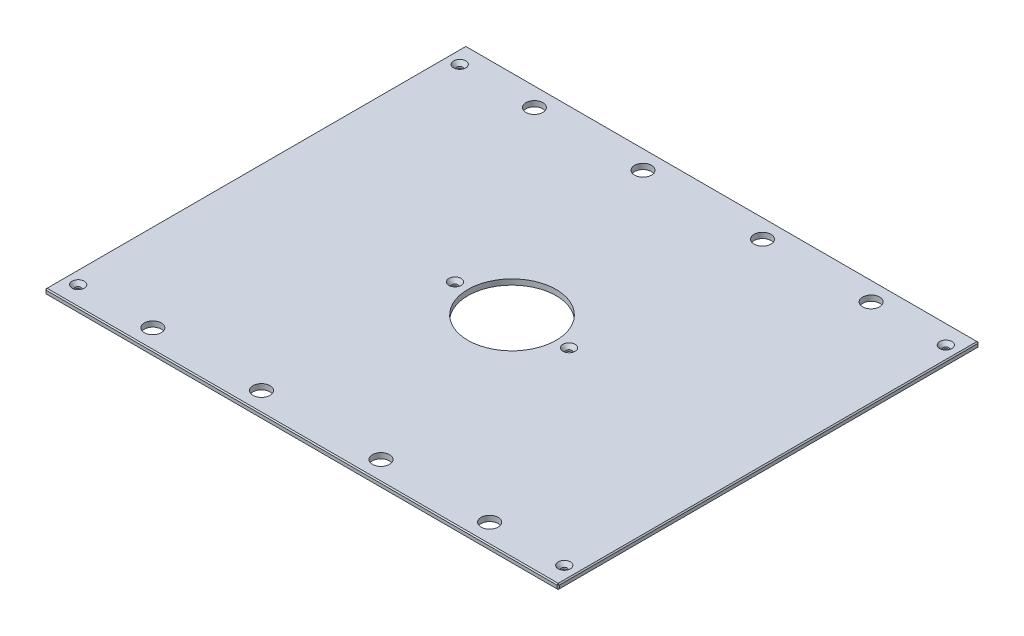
ISO-10303-21;
HEADER;
FILE_DESCRIPTION(('STEP AP214'),'2;1');
FILE_NAME('part.step','',(''),(''),'','','');
FILE_SCHEMA(('AUTOMOTIVE_DESIGN { 1 0 10303 214 1 1 1 1 }'));
ENDSEC;
DATA;
#1=APPLICATION_CONTEXT('core data for automotive mechanical design processes');
#2=APPLICATION_PROTOCOL_DEFINITION('international standard','automotive_design',2000,#1);
#3=PRODUCT_CONTEXT('',#1,'mechanical');
#4=PRODUCT('Part','Part','',(#3));
#5=PRODUCT_RELATED_PRODUCT_CATEGORY('part','',(#4));
#6=PRODUCT_DEFINITION_FORMATION('','',#4);
#7=PRODUCT_DEFINITION_CONTEXT('part definition',#1,'design');
#8=PRODUCT_DEFINITION('design','',#6,#7);
#9=PRODUCT_DEFINITION_SHAPE('','',#8);
#10=(LENGTH_UNIT() NAMED_UNIT(*) SI_UNIT(.MILLI.,.METRE.));
#11=(NAMED_UNIT(*) PLANE_ANGLE_UNIT() SI_UNIT($,.RADIAN.));
#12=(NAMED_UNIT(*) SI_UNIT($,.STERADIAN.) SOLID_ANGLE_UNIT());
#13=UNCERTAINTY_MEASURE_WITH_UNIT(LENGTH_MEASURE(1.E-05),#10,'distance_accuracy_value','');
#14=(GEOMETRIC_REPRESENTATION_CONTEXT(3) GLOBAL_UNCERTAINTY_ASSIGNED_CONTEXT((#13)) GLOBAL_UNIT_ASSIGNED_CONTEXT((#10,
#11,#12)) REPRESENTATION_CONTEXT('',''));
#15=CARTESIAN_POINT('',(0.,0.,0.));
#16=DIRECTION('',(0.,0.,1.));
#17=DIRECTION('',(1.,0.,0.));
#18=AXIS2_PLACEMENT_3D('',#15,#16,#17);
#19=CARTESIAN_POINT('',(-300.0375,6.35,-246.0625));
#20=DIRECTION('',(1.,0.,0.));
#21=DIRECTION('',(0.,0.,-1.));
#22=AXIS2_PLACEMENT_3D('',#19,#20,#21);
#23=PLANE('',#22);
#24=DIRECTION('',(0.,0.,-1.));
#25=VECTOR('',#24,1.);
#26=CARTESIAN_POINT('',(-300.0375,5.08000000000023,-246.0625));
#27=LINE('',#26,#25);
#28=CARTESIAN_POINT('',(-300.0375,5.08000000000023,244.7925));
#29=VERTEX_POINT('',#28);
#30=CARTESIAN_POINT('',(-300.0375,5.08000000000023,-244.7925));
#31=VERTEX_POINT('',#30);
#32=EDGE_CURVE('E135',#29,#31,#27,.T.);
#33=ORIENTED_EDGE('',*,*,#32,.T.);
#34=DIRECTION('',(0.,-1.,0.));
#35=VECTOR('',#34,1.);
#36=CARTESIAN_POINT('',(-300.0375,6.35,-244.7925));
#37=LINE('',#36,#35);
#38=CARTESIAN_POINT('',(-300.0375,1.26999999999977,-244.7925));
#39=VERTEX_POINT('',#38);
#40=EDGE_CURVE('E131',#31,#39,#37,.T.);
#41=ORIENTED_EDGE('',*,*,#40,.T.);
#42=DIRECTION('',(0.,0.,1.));
#43=VECTOR('',#42,1.);
#44=CARTESIAN_POINT('',(-300.0375,1.26999999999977,-246.0625));
#45=LINE('',#44,#43);
#46=CARTESIAN_POINT('',(-300.0375,1.26999999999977,244.7925));
#47=VERTEX_POINT('',#46);
#48=EDGE_CURVE('E126',#39,#47,#45,.T.);
#49=ORIENTED_EDGE('',*,*,#48,.T.);
#50=DIRECTION('',(0.,1.,0.));
#51=VECTOR('',#50,1.);
#52=CARTESIAN_POINT('',(-300.0375,6.35,244.7925));
#53=LINE('',#52,#51);
#54=EDGE_CURVE('E128',#47,#29,#53,.T.);
#55=ORIENTED_EDGE('',*,*,#54,.T.);
#56=EDGE_LOOP('',(#33,#41,#49,#55));
#57=FACE_BOUND('',#56,.T.);
#58=ADVANCED_FACE('F35',(#57),#23,.F.);
#59=CARTESIAN_POINT('',(-300.0375,6.35,246.0625));
#60=DIRECTION('',(0.,0.,-1.));
#61=DIRECTION('',(-1.,0.,0.));
#62=AXIS2_PLACEMENT_3D('',#59,#60,#61);
#63=PLANE('',#62);
#64=DIRECTION('',(1.,0.,0.));
#65=VECTOR('',#64,1.);
#66=CARTESIAN_POINT('',(-300.0375,1.26999999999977,246.0625));
#67=LINE('',#66,#65);
#68=CARTESIAN_POINT('',(-298.7675,1.26999999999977,246.0625));
#69=VERTEX_POINT('',#68);
#70=CARTESIAN_POINT('',(298.7675,1.26999999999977,246.0625));
#71=VERTEX_POINT('',#70);
#72=EDGE_CURVE('E58',#69,#71,#67,.T.);
#73=ORIENTED_EDGE('',*,*,#72,.T.);
#74=DIRECTION('',(0.,1.,0.));
#75=VECTOR('',#74,1.);
#76=CARTESIAN_POINT('',(298.7675,6.35,246.0625));
#77=LINE('',#76,#75);
#78=CARTESIAN_POINT('',(298.7675,5.08000000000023,246.0625));
#79=VERTEX_POINT('',#78);
#80=EDGE_CURVE('E11',#71,#79,#77,.T.);
#81=ORIENTED_EDGE('',*,*,#80,.T.);
#82=DIRECTION('',(-1.,0.,0.));
#83=VECTOR('',#82,1.);
#84=CARTESIAN_POINT('',(-300.0375,5.08000000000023,246.0625));
#85=LINE('',#84,#83);
#86=CARTESIAN_POINT('',(-298.7675,5.08000000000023,246.0625));
#87=VERTEX_POINT('',#86);
#88=EDGE_CURVE('E44',#79,#87,#85,.T.);
#89=ORIENTED_EDGE('',*,*,#88,.T.);
#90=DIRECTION('',(0.,-1.,0.));
#91=VECTOR('',#90,1.);
#92=CARTESIAN_POINT('',(-298.7675,6.35,246.0625));
#93=LINE('',#92,#91);
#94=EDGE_CURVE('E303',#87,#69,#93,.T.);
#95=ORIENTED_EDGE('',*,*,#94,.T.);
#96=EDGE_LOOP('',(#73,#81,#89,#95));
#97=FACE_BOUND('',#96,.T.);
#98=ADVANCED_FACE('F372',(#97),#63,.F.);
#99=CARTESIAN_POINT('',(300.0375,6.35,-246.0625));
#100=DIRECTION('',(-1.,0.,0.));
#101=DIRECTION('',(0.,0.,1.));
#102=AXIS2_PLACEMENT_3D('',#99,#100,#101);
#103=PLANE('',#102);
#104=DIRECTION('',(0.,0.,-1.));
#105=VECTOR('',#104,1.);
#106=CARTESIAN_POINT('',(300.0375,1.26999999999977,-246.0625));
#107=LINE('',#106,#105);
#108=CARTESIAN_POINT('',(300.0375,1.26999999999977,244.7925));
#109=VERTEX_POINT('',#108);
#110=CARTESIAN_POINT('',(300.0375,1.26999999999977,-244.7925));
#111=VERTEX_POINT('',#110);
#112=EDGE_CURVE('E298',#109,#111,#107,.T.);
#113=ORIENTED_EDGE('',*,*,#112,.T.);
#114=DIRECTION('',(0.,1.,0.));
#115=VECTOR('',#114,1.);
#116=CARTESIAN_POINT('',(300.0375,6.35,-244.7925));
#117=LINE('',#116,#115);
#118=CARTESIAN_POINT('',(300.0375,5.08000000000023,-244.7925));
#119=VERTEX_POINT('',#118);
#120=EDGE_CURVE('E300',#111,#119,#117,.T.);
#121=ORIENTED_EDGE('',*,*,#120,.T.);
#122=DIRECTION('',(0.,0.,1.));
#123=VECTOR('',#122,1.);
#124=CARTESIAN_POINT('',(300.0375,5.08000000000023,246.0625));
#125=LINE('',#124,#123);
#126=CARTESIAN_POINT('',(300.0375,5.08000000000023,244.7925));
#127=VERTEX_POINT('',#126);
#128=EDGE_CURVE('E296',#119,#127,#125,.T.);
#129=ORIENTED_EDGE('',*,*,#128,.T.);
#130=DIRECTION('',(0.,-1.,0.));
#131=VECTOR('',#130,1.);
#132=CARTESIAN_POINT('',(300.0375,6.35,244.7925));
#133=LINE('',#132,#131);
#134=EDGE_CURVE('E294',#127,#109,#133,.T.);
#135=ORIENTED_EDGE('',*,*,#134,.T.);
#136=EDGE_LOOP('',(#113,#121,#129,#135));
#137=FACE_BOUND('',#136,.T.);
#138=ADVANCED_FACE('F359',(#137),#103,.F.);
#139=CARTESIAN_POINT('',(-300.0375,6.35,-246.0625));
#140=DIRECTION('',(0.,0.,1.));
#141=DIRECTION('',(1.,0.,0.));
#142=AXIS2_PLACEMENT_3D('',#139,#140,#141);
#143=PLANE('',#142);
#144=DIRECTION('',(-1.,0.,0.));
#145=VECTOR('',#144,1.);
#146=CARTESIAN_POINT('',(-300.0375,1.26999999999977,-246.0625));
#147=LINE('',#146,#145);
#148=CARTESIAN_POINT('',(298.7675,1.26999999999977,-246.0625));
#149=VERTEX_POINT('',#148);
#150=CARTESIAN_POINT('',(-298.7675,1.26999999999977,-246.0625));
#151=VERTEX_POINT('',#150);
#152=EDGE_CURVE('E270',#149,#151,#147,.T.);
#153=ORIENTED_EDGE('',*,*,#152,.T.);
#154=DIRECTION('',(0.,1.,0.));
#155=VECTOR('',#154,1.);
#156=CARTESIAN_POINT('',(-298.7675,6.35,-246.0625));
#157=LINE('',#156,#155);
#158=CARTESIAN_POINT('',(-298.7675,5.08000000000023,-246.0625));
#159=VERTEX_POINT('',#158);
#160=EDGE_CURVE('E274',#151,#159,#157,.T.);
#161=ORIENTED_EDGE('',*,*,#160,.T.);
#162=DIRECTION('',(1.,0.,0.));
#163=VECTOR('',#162,1.);
#164=CARTESIAN_POINT('',(300.0375,5.08000000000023,-246.0625));
#165=LINE('',#164,#163);
#166=CARTESIAN_POINT('',(298.7675,5.08000000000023,-246.0625));
#167=VERTEX_POINT('',#166);
#168=EDGE_CURVE('E272',#159,#167,#165,.T.);
#169=ORIENTED_EDGE('',*,*,#168,.T.);
#170=DIRECTION('',(0.,-1.,0.));
#171=VECTOR('',#170,1.);
#172=CARTESIAN_POINT('',(298.7675,6.35,-246.0625));
#173=LINE('',#172,#171);
#174=EDGE_CURVE('E268',#167,#149,#173,.T.);
#175=ORIENTED_EDGE('',*,*,#174,.T.);
#176=EDGE_LOOP('',(#153,#161,#169,#175));
#177=FACE_BOUND('',#176,.T.);
#178=ADVANCED_FACE('F333',(#177),#143,.F.);
#179=CARTESIAN_POINT('',(0.,6.35,0.));
#180=DIRECTION('',(0.,1.,0.));
#181=DIRECTION('',(0.,0.,1.));
#182=AXIS2_PLACEMENT_3D('',#179,#180,#181);
#183=PLANE('',#182);
#184=CARTESIAN_POINT('',(284.1625,6.35,-223.04248));
#185=DIRECTION('',(0.,1.,0.));
#186=DIRECTION('',(0.,0.,1.));
#187=AXIS2_PLACEMENT_3D('',#184,#185,#186);
#188=CIRCLE('',#187,7.13740000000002);
#189=CARTESIAN_POINT('',(284.1625,6.35,-215.90508));
#190=VERTEX_POINT('',#189);
#191=EDGE_CURVE('E816',#190,#190,#188,.T.);
#192=ORIENTED_EDGE('',*,*,#191,.F.);
#193=EDGE_LOOP('',(#192));
#194=FACE_BOUND('',#193,.T.);
#195=CARTESIAN_POINT('',(284.1625,6.35,223.04248));
#196=DIRECTION('',(0.,1.,0.));
#197=DIRECTION('',(0.,0.,1.));
#198=AXIS2_PLACEMENT_3D('',#195,#196,#197);
#199=CIRCLE('',#198,7.13740000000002);
#200=CARTESIAN_POINT('',(284.1625,6.35,230.17988));
#201=VERTEX_POINT('',#200);
#202=EDGE_CURVE('E820',#201,#201,#199,.T.);
#203=ORIENTED_EDGE('',*,*,#202,.F.);
#204=EDGE_LOOP('',(#203));
#205=FACE_BOUND('',#204,.T.);
#206=CARTESIAN_POINT('',(-284.1625,6.35,223.04248));
#207=DIRECTION('',(0.,1.,0.));
#208=DIRECTION('',(0.,0.,1.));
#209=AXIS2_PLACEMENT_3D('',#206,#207,#208);
#210=CIRCLE('',#209,7.13740000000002);
#211=CARTESIAN_POINT('',(-284.1625,6.35,230.17988));
#212=VERTEX_POINT('',#211);
#213=EDGE_CURVE('E824',#212,#212,#210,.T.);
#214=ORIENTED_EDGE('',*,*,#213,.F.);
#215=EDGE_LOOP('',(#214));
#216=FACE_BOUND('',#215,.T.);
#217=CARTESIAN_POINT('',(-66.675,6.35,0.));
#218=DIRECTION('',(0.,1.,0.));
#219=DIRECTION('',(0.,0.,1.));
#220=AXIS2_PLACEMENT_3D('',#217,#218,#219);
#221=CIRCLE('',#220,7.1374);
#222=CARTESIAN_POINT('',(-66.675,6.35,7.1374));
#223=VERTEX_POINT('',#222);
#224=EDGE_CURVE('E828',#223,#223,#221,.T.);
#225=ORIENTED_EDGE('',*,*,#224,.F.);
#226=EDGE_LOOP('',(#225));
#227=FACE_BOUND('',#226,.T.);
#228=CARTESIAN_POINT('',(66.675,6.35,0.));
#229=DIRECTION('',(0.,1.,0.));
#230=DIRECTION('',(0.,0.,1.));
#231=AXIS2_PLACEMENT_3D('',#228,#229,#230);
#232=CIRCLE('',#231,7.1374);
#233=CARTESIAN_POINT('',(66.675,6.35,7.1374));
#234=VERTEX_POINT('',#233);
#235=EDGE_CURVE('E832',#234,#234,#232,.T.);
#236=ORIENTED_EDGE('',*,*,#235,.F.);
#237=EDGE_LOOP('',(#236));
#238=FACE_BOUND('',#237,.T.);
#239=CARTESIAN_POINT('',(-284.1625,6.35,-223.04248));
#240=DIRECTION('',(0.,1.,0.));
#241=DIRECTION('',(0.,0.,1.));
#242=AXIS2_PLACEMENT_3D('',#239,#240,#241);
#243=CIRCLE('',#242,7.13740000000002);
#244=CARTESIAN_POINT('',(-284.1625,6.35,-215.90508));
#245=VERTEX_POINT('',#244);
#246=EDGE_CURVE('E835',#245,#245,#243,.T.);
#247=ORIENTED_EDGE('',*,*,#246,.F.);
#248=EDGE_LOOP('',(#247));
#249=FACE_BOUND('',#248,.T.);
#250=DIRECTION('',(0.,0.,-1.));
#251=VECTOR('',#250,1.);
#252=CARTESIAN_POINT('',(298.7675,6.35,-246.0625));
#253=LINE('',#252,#251);
#254=CARTESIAN_POINT('',(298.7675,6.35,244.7925));
#255=VERTEX_POINT('',#254);
#256=CARTESIAN_POINT('',(298.7675,6.35,-244.7925));
#257=VERTEX_POINT('',#256);
#258=EDGE_CURVE('E281',#255,#257,#253,.T.);
#259=ORIENTED_EDGE('',*,*,#258,.T.);
#260=DIRECTION('',(-1.,0.,0.));
#261=VECTOR('',#260,1.);
#262=CARTESIAN_POINT('',(-300.0375,6.35,-244.7925));
#263=LINE('',#262,#261);
#264=CARTESIAN_POINT('',(-298.7675,6.35,-244.7925));
#265=VERTEX_POINT('',#264);
#266=EDGE_CURVE('E283',#257,#265,#263,.T.);
#267=ORIENTED_EDGE('',*,*,#266,.T.);
#268=DIRECTION('',(0.,0.,1.));
#269=VECTOR('',#268,1.);
#270=CARTESIAN_POINT('',(-298.7675,6.35,246.0625));
#271=LINE('',#270,#269);
#272=CARTESIAN_POINT('',(-298.7675,6.35,244.7925));
#273=VERTEX_POINT('',#272);
#274=EDGE_CURVE('E279',#265,#273,#271,.T.);
#275=ORIENTED_EDGE('',*,*,#274,.T.);
#276=DIRECTION('',(1.,0.,0.));
#277=VECTOR('',#276,1.);
#278=CARTESIAN_POINT('',(300.0375,6.35,244.7925));
#279=LINE('',#278,#277);
#280=EDGE_CURVE('E277',#273,#255,#279,.T.);
#281=ORIENTED_EDGE('',*,*,#280,.T.);
#282=EDGE_LOOP('',(#259,#267,#275,#281));
#283=FACE_BOUND('',#282,.T.);
#284=CARTESIAN_POINT('',(196.85,6.35,-223.04248));
#285=DIRECTION('',(0.,1.,0.));
#286=DIRECTION('',(0.,0.,1.));
#287=AXIS2_PLACEMENT_3D('',#284,#285,#286);
#288=CIRCLE('',#287,9.921875);
#289=CARTESIAN_POINT('',(196.85,6.35,-213.120605));
#290=VERTEX_POINT('',#289);
#291=EDGE_CURVE('E204',#290,#290,#288,.T.);
#292=ORIENTED_EDGE('',*,*,#291,.F.);
#293=EDGE_LOOP('',(#292));
#294=FACE_BOUND('',#293,.T.);
#295=CARTESIAN_POINT('',(-196.85,6.35,-223.04248));
#296=DIRECTION('',(0.,1.,0.));
#297=DIRECTION('',(0.,0.,1.));
#298=AXIS2_PLACEMENT_3D('',#295,#296,#297);
#299=CIRCLE('',#298,9.921875);
#300=CARTESIAN_POINT('',(-196.85,6.35,-213.120605));
#301=VERTEX_POINT('',#300);
#302=EDGE_CURVE('E214',#301,#301,#299,.T.);
#303=ORIENTED_EDGE('',*,*,#302,.F.);
#304=EDGE_LOOP('',(#303));
#305=FACE_BOUND('',#304,.T.);
#306=CARTESIAN_POINT('',(196.85,6.35,223.04248));
#307=DIRECTION('',(0.,1.,0.));
#308=DIRECTION('',(0.,0.,1.));
#309=AXIS2_PLACEMENT_3D('',#306,#307,#308);
#310=CIRCLE('',#309,9.921875);
#311=CARTESIAN_POINT('',(196.85,6.35,232.964355));
#312=VERTEX_POINT('',#311);
#313=EDGE_CURVE('E225',#312,#312,#310,.T.);
#314=ORIENTED_EDGE('',*,*,#313,.F.);
#315=EDGE_LOOP('',(#314));
#316=FACE_BOUND('',#315,.T.);
#317=CARTESIAN_POINT('',(-196.85,6.35,223.04248));
#318=DIRECTION('',(0.,1.,0.));
#319=DIRECTION('',(0.,0.,1.));
#320=AXIS2_PLACEMENT_3D('',#317,#318,#319);
#321=CIRCLE('',#320,9.921875);
#322=CARTESIAN_POINT('',(-196.85,6.35,232.964355));
#323=VERTEX_POINT('',#322);
#324=EDGE_CURVE('E231',#323,#323,#321,.T.);
#325=ORIENTED_EDGE('',*,*,#324,.F.);
#326=EDGE_LOOP('',(#325));
#327=FACE_BOUND('',#326,.T.);
#328=CARTESIAN_POINT('',(-69.85,6.35,-223.04248));
#329=DIRECTION('',(0.,1.,0.));
#330=DIRECTION('',(0.,0.,1.));
#331=AXIS2_PLACEMENT_3D('',#328,#329,#330);
#332=CIRCLE('',#331,9.921875);
#333=CARTESIAN_POINT('',(-69.85,6.35,-213.120605));
#334=VERTEX_POINT('',#333);
#335=EDGE_CURVE('E237',#334,#334,#332,.T.);
#336=ORIENTED_EDGE('',*,*,#335,.F.);
#337=EDGE_LOOP('',(#336));
#338=FACE_BOUND('',#337,.T.);
#339=CARTESIAN_POINT('',(69.85,6.35,-223.04248));
#340=DIRECTION('',(0.,1.,0.));
#341=DIRECTION('',(0.,0.,1.));
#342=AXIS2_PLACEMENT_3D('',#339,#340,#341);
#343=CIRCLE('',#342,9.921875);
#344=CARTESIAN_POINT('',(69.85,6.35,-213.120605));
#345=VERTEX_POINT('',#344);
#346=EDGE_CURVE('E243',#345,#345,#343,.T.);
#347=ORIENTED_EDGE('',*,*,#346,.F.);
#348=EDGE_LOOP('',(#347));
#349=FACE_BOUND('',#348,.T.);
#350=CARTESIAN_POINT('',(69.85,6.35,223.04248));
#351=DIRECTION('',(0.,1.,0.));
#352=DIRECTION('',(0.,0.,1.));
#353=AXIS2_PLACEMENT_3D('',#350,#351,#352);
#354=CIRCLE('',#353,9.921875);
#355=CARTESIAN_POINT('',(69.85,6.35,232.964355));
#356=VERTEX_POINT('',#355);
#357=EDGE_CURVE('E249',#356,#356,#354,.T.);
#358=ORIENTED_EDGE('',*,*,#357,.F.);
#359=EDGE_LOOP('',(#358));
#360=FACE_BOUND('',#359,.T.);
#361=CARTESIAN_POINT('',(-69.85,6.35,223.04248));
#362=DIRECTION('',(0.,1.,0.));
#363=DIRECTION('',(0.,0.,1.));
#364=AXIS2_PLACEMENT_3D('',#361,#362,#363);
#365=CIRCLE('',#364,9.921875);
#366=CARTESIAN_POINT('',(-69.85,6.35,232.964355));
#367=VERTEX_POINT('',#366);
#368=EDGE_CURVE('E255',#367,#367,#365,.T.);
#369=ORIENTED_EDGE('',*,*,#368,.F.);
#370=EDGE_LOOP('',(#369));
#371=FACE_BOUND('',#370,.T.);
#372=CARTESIAN_POINT('',(0.,6.35,0.));
#373=DIRECTION('',(0.,1.,0.));
#374=DIRECTION('',(0.,0.,1.));
#375=AXIS2_PLACEMENT_3D('',#372,#373,#374);
#376=CIRCLE('',#375,51.562);
#377=CARTESIAN_POINT('',(0.,6.35,51.562));
#378=VERTEX_POINT('',#377);
#379=EDGE_CURVE('E261',#378,#378,#376,.T.);
#380=ORIENTED_EDGE('',*,*,#379,.F.);
#381=EDGE_LOOP('',(#380));
#382=FACE_BOUND('',#381,.T.);
#383=ADVANCED_FACE('F381',(#194,#205,#216,#227,#238,#249,#283,#294,#305,#316,#327,#338,#349,
#360,#371,#382),#183,.T.);
#384=CARTESIAN_POINT('',(0.,0.,0.));
#385=DIRECTION('',(0.,1.,0.));
#386=DIRECTION('',(0.,0.,1.));
#387=AXIS2_PLACEMENT_3D('',#384,#385,#386);
#388=PLANE('',#387);
#389=CARTESIAN_POINT('',(284.1625,0.,-223.04248));
#390=DIRECTION('',(0.,1.,0.));
#391=DIRECTION('',(0.,0.,1.));
#392=AXIS2_PLACEMENT_3D('',#389,#390,#391);
#393=CIRCLE('',#392,3.3782);
#394=CARTESIAN_POINT('',(284.1625,0.,-219.66428));
#395=VERTEX_POINT('',#394);
#396=EDGE_CURVE('E869',#395,#395,#393,.T.);
#397=ORIENTED_EDGE('',*,*,#396,.T.);
#398=EDGE_LOOP('',(#397));
#399=FACE_BOUND('',#398,.T.);
#400=CARTESIAN_POINT('',(284.1625,0.,223.04248));
#401=DIRECTION('',(0.,1.,0.));
#402=DIRECTION('',(0.,0.,1.));
#403=AXIS2_PLACEMENT_3D('',#400,#401,#402);
#404=CIRCLE('',#403,3.3782);
#405=CARTESIAN_POINT('',(284.1625,0.,226.42068));
#406=VERTEX_POINT('',#405);
#407=EDGE_CURVE('E862',#406,#406,#404,.T.);
#408=ORIENTED_EDGE('',*,*,#407,.T.);
#409=EDGE_LOOP('',(#408));
#410=FACE_BOUND('',#409,.T.);
#411=CARTESIAN_POINT('',(-284.1625,0.,223.04248));
#412=DIRECTION('',(0.,1.,0.));
#413=DIRECTION('',(0.,0.,1.));
#414=AXIS2_PLACEMENT_3D('',#411,#412,#413);
#415=CIRCLE('',#414,3.3782);
#416=CARTESIAN_POINT('',(-284.1625,0.,226.42068));
#417=VERTEX_POINT('',#416);
#418=EDGE_CURVE('E855',#417,#417,#415,.T.);
#419=ORIENTED_EDGE('',*,*,#418,.T.);
#420=EDGE_LOOP('',(#419));
#421=FACE_BOUND('',#420,.T.);
#422=CARTESIAN_POINT('',(-66.675,0.,0.));
#423=DIRECTION('',(0.,1.,0.));
#424=DIRECTION('',(0.,0.,1.));
#425=AXIS2_PLACEMENT_3D('',#422,#423,#424);
#426=CIRCLE('',#425,3.3782);
#427=CARTESIAN_POINT('',(-66.675,0.,3.3782));
#428=VERTEX_POINT('',#427);
#429=EDGE_CURVE('E848',#428,#428,#426,.T.);
#430=ORIENTED_EDGE('',*,*,#429,.T.);
#431=EDGE_LOOP('',(#430));
#432=FACE_BOUND('',#431,.T.);
#433=CARTESIAN_POINT('',(66.675,0.,0.));
#434=DIRECTION('',(0.,1.,0.));
#435=DIRECTION('',(0.,0.,1.));
#436=AXIS2_PLACEMENT_3D('',#433,#434,#435);
#437=CIRCLE('',#436,3.3782);
#438=CARTESIAN_POINT('',(66.675,0.,3.3782));
#439=VERTEX_POINT('',#438);
#440=EDGE_CURVE('E838',#439,#439,#437,.T.);
#441=ORIENTED_EDGE('',*,*,#440,.T.);
#442=EDGE_LOOP('',(#441));
#443=FACE_BOUND('',#442,.T.);
#444=CARTESIAN_POINT('',(-284.1625,0.,-223.04248));
#445=DIRECTION('',(0.,1.,0.));
#446=DIRECTION('',(0.,0.,1.));
#447=AXIS2_PLACEMENT_3D('',#444,#445,#446);
#448=CIRCLE('',#447,3.3782);
#449=CARTESIAN_POINT('',(-284.1625,0.,-219.66428));
#450=VERTEX_POINT('',#449);
#451=EDGE_CURVE('E217',#450,#450,#448,.T.);
#452=ORIENTED_EDGE('',*,*,#451,.T.);
#453=EDGE_LOOP('',(#452));
#454=FACE_BOUND('',#453,.T.);
#455=DIRECTION('',(0.,0.,-1.));
#456=VECTOR('',#455,1.);
#457=CARTESIAN_POINT('',(-298.7675,0.,0.));
#458=LINE('',#457,#456);
#459=CARTESIAN_POINT('',(-298.7675,0.,244.7925));
#460=VERTEX_POINT('',#459);
#461=CARTESIAN_POINT('',(-298.7675,0.,-244.7925));
#462=VERTEX_POINT('',#461);
#463=EDGE_CURVE('E158',#460,#462,#458,.T.);
#464=ORIENTED_EDGE('',*,*,#463,.T.);
#465=DIRECTION('',(1.,0.,0.));
#466=VECTOR('',#465,1.);
#467=CARTESIAN_POINT('',(0.,0.,-244.7925));
#468=LINE('',#467,#466);
#469=CARTESIAN_POINT('',(298.7675,0.,-244.7925));
#470=VERTEX_POINT('',#469);
#471=EDGE_CURVE('E291',#462,#470,#468,.T.);
#472=ORIENTED_EDGE('',*,*,#471,.T.);
#473=DIRECTION('',(0.,0.,1.));
#474=VECTOR('',#473,1.);
#475=CARTESIAN_POINT('',(298.7675,0.,0.));
#476=LINE('',#475,#474);
#477=CARTESIAN_POINT('',(298.7675,0.,244.7925));
#478=VERTEX_POINT('',#477);
#479=EDGE_CURVE('E289',#470,#478,#476,.T.);
#480=ORIENTED_EDGE('',*,*,#479,.T.);
#481=DIRECTION('',(-1.,0.,0.));
#482=VECTOR('',#481,1.);
#483=CARTESIAN_POINT('',(0.,0.,244.7925));
#484=LINE('',#483,#482);
#485=EDGE_CURVE('E286',#478,#460,#484,.T.);
#486=ORIENTED_EDGE('',*,*,#485,.T.);
#487=EDGE_LOOP('',(#464,#472,#480,#486));
#488=FACE_BOUND('',#487,.T.);
#489=CARTESIAN_POINT('',(196.85,0.,-223.04248));
#490=DIRECTION('',(0.,1.,0.));
#491=DIRECTION('',(0.,0.,1.));
#492=AXIS2_PLACEMENT_3D('',#489,#490,#491);
#493=CIRCLE('',#492,9.921875);
#494=CARTESIAN_POINT('',(196.85,0.,-213.120605));
#495=VERTEX_POINT('',#494);
#496=EDGE_CURVE('E209',#495,#495,#493,.T.);
#497=ORIENTED_EDGE('',*,*,#496,.T.);
#498=EDGE_LOOP('',(#497));
#499=FACE_BOUND('',#498,.T.);
#500=CARTESIAN_POINT('',(-196.85,0.,-223.04248));
#501=DIRECTION('',(0.,1.,0.));
#502=DIRECTION('',(0.,0.,1.));
#503=AXIS2_PLACEMENT_3D('',#500,#501,#502);
#504=CIRCLE('',#503,9.921875);
#505=CARTESIAN_POINT('',(-196.85,0.,-213.120605));
#506=VERTEX_POINT('',#505);
#507=EDGE_CURVE('E222',#506,#506,#504,.T.);
#508=ORIENTED_EDGE('',*,*,#507,.T.);
#509=EDGE_LOOP('',(#508));
#510=FACE_BOUND('',#509,.T.);
#511=CARTESIAN_POINT('',(196.85,0.,223.04248));
#512=DIRECTION('',(0.,1.,0.));
#513=DIRECTION('',(0.,0.,1.));
#514=AXIS2_PLACEMENT_3D('',#511,#512,#513);
#515=CIRCLE('',#514,9.921875);
#516=CARTESIAN_POINT('',(196.85,0.,232.964355));
#517=VERTEX_POINT('',#516);
#518=EDGE_CURVE('E228',#517,#517,#515,.T.);
#519=ORIENTED_EDGE('',*,*,#518,.T.);
#520=EDGE_LOOP('',(#519));
#521=FACE_BOUND('',#520,.T.);
#522=CARTESIAN_POINT('',(-196.85,0.,223.04248));
#523=DIRECTION('',(0.,1.,0.));
#524=DIRECTION('',(0.,0.,1.));
#525=AXIS2_PLACEMENT_3D('',#522,#523,#524);
#526=CIRCLE('',#525,9.921875);
#527=CARTESIAN_POINT('',(-196.85,0.,232.964355));
#528=VERTEX_POINT('',#527);
#529=EDGE_CURVE('E234',#528,#528,#526,.T.);
#530=ORIENTED_EDGE('',*,*,#529,.T.);
#531=EDGE_LOOP('',(#530));
#532=FACE_BOUND('',#531,.T.);
#533=CARTESIAN_POINT('',(-69.85,0.,-223.04248));
#534=DIRECTION('',(0.,1.,0.));
#535=DIRECTION('',(0.,0.,1.));
#536=AXIS2_PLACEMENT_3D('',#533,#534,#535);
#537=CIRCLE('',#536,9.921875);
#538=CARTESIAN_POINT('',(-69.85,0.,-213.120605));
#539=VERTEX_POINT('',#538);
#540=EDGE_CURVE('E240',#539,#539,#537,.T.);
#541=ORIENTED_EDGE('',*,*,#540,.T.);
#542=EDGE_LOOP('',(#541));
#543=FACE_BOUND('',#542,.T.);
#544=CARTESIAN_POINT('',(69.85,0.,-223.04248));
#545=DIRECTION('',(0.,1.,0.));
#546=DIRECTION('',(0.,0.,1.));
#547=AXIS2_PLACEMENT_3D('',#544,#545,#546);
#548=CIRCLE('',#547,9.921875);
#549=CARTESIAN_POINT('',(69.85,0.,-213.120605));
#550=VERTEX_POINT('',#549);
#551=EDGE_CURVE('E246',#550,#550,#548,.T.);
#552=ORIENTED_EDGE('',*,*,#551,.T.);
#553=EDGE_LOOP('',(#552));
#554=FACE_BOUND('',#553,.T.);
#555=CARTESIAN_POINT('',(69.85,0.,223.04248));
#556=DIRECTION('',(0.,1.,0.));
#557=DIRECTION('',(0.,0.,1.));
#558=AXIS2_PLACEMENT_3D('',#555,#556,#557);
#559=CIRCLE('',#558,9.921875);
#560=CARTESIAN_POINT('',(69.85,0.,232.964355));
#561=VERTEX_POINT('',#560);
#562=EDGE_CURVE('E252',#561,#561,#559,.T.);
#563=ORIENTED_EDGE('',*,*,#562,.T.);
#564=EDGE_LOOP('',(#563));
#565=FACE_BOUND('',#564,.T.);
#566=CARTESIAN_POINT('',(-69.85,0.,223.04248));
#567=DIRECTION('',(0.,1.,0.));
#568=DIRECTION('',(0.,0.,1.));
#569=AXIS2_PLACEMENT_3D('',#566,#567,#568);
#570=CIRCLE('',#569,9.921875);
#571=CARTESIAN_POINT('',(-69.85,0.,232.964355));
#572=VERTEX_POINT('',#571);
#573=EDGE_CURVE('E258',#572,#572,#570,.T.);
#574=ORIENTED_EDGE('',*,*,#573,.T.);
#575=EDGE_LOOP('',(#574));
#576=FACE_BOUND('',#575,.T.);
#577=CARTESIAN_POINT('',(0.,0.,0.));
#578=DIRECTION('',(0.,1.,0.));
#579=DIRECTION('',(0.,0.,1.));
#580=AXIS2_PLACEMENT_3D('',#577,#578,#579);
#581=CIRCLE('',#580,51.562);
#582=CARTESIAN_POINT('',(0.,0.,51.562));
#583=VERTEX_POINT('',#582);
#584=EDGE_CURVE('E147',#583,#583,#581,.T.);
#585=ORIENTED_EDGE('',*,*,#584,.T.);
#586=EDGE_LOOP('',(#585));
#587=FACE_BOUND('',#586,.T.);
#588=ADVANCED_FACE('F346',(#399,#410,#421,#432,#443,#454,#488,#499,#510,#521,#532,#543,#554,
#565,#576,#587),#388,.F.);
#589=CARTESIAN_POINT('',(0.,0.,0.));
#590=DIRECTION('',(0.,1.,0.));
#591=DIRECTION('',(0.,0.,1.));
#592=AXIS2_PLACEMENT_3D('',#589,#590,#591);
#593=CYLINDRICAL_SURFACE('',#592,51.562);
#594=ORIENTED_EDGE('',*,*,#584,.F.);
#595=EDGE_LOOP('',(#594));
#596=FACE_BOUND('',#595,.T.);
#597=ORIENTED_EDGE('',*,*,#379,.T.);
#598=EDGE_LOOP('',(#597));
#599=FACE_BOUND('',#598,.T.);
#600=ADVANCED_FACE('F751',(#596,#599),#593,.F.);
#601=CARTESIAN_POINT('',(-69.85,6.35,223.04248));
#602=DIRECTION('',(0.,1.,0.));
#603=DIRECTION('',(0.,0.,1.));
#604=AXIS2_PLACEMENT_3D('',#601,#602,#603);
#605=CYLINDRICAL_SURFACE('',#604,9.921875);
#606=ORIENTED_EDGE('',*,*,#573,.F.);
#607=EDGE_LOOP('',(#606));
#608=FACE_BOUND('',#607,.T.);
#609=ORIENTED_EDGE('',*,*,#368,.T.);
#610=EDGE_LOOP('',(#609));
#611=FACE_BOUND('',#610,.T.);
#612=ADVANCED_FACE('F742',(#608,#611),#605,.F.);
#613=CARTESIAN_POINT('',(69.85,6.35,223.04248));
#614=DIRECTION('',(0.,1.,0.));
#615=DIRECTION('',(0.,0.,1.));
#616=AXIS2_PLACEMENT_3D('',#613,#614,#615);
#617=CYLINDRICAL_SURFACE('',#616,9.921875);
#618=ORIENTED_EDGE('',*,*,#562,.F.);
#619=EDGE_LOOP('',(#618));
#620=FACE_BOUND('',#619,.T.);
#621=ORIENTED_EDGE('',*,*,#357,.T.);
#622=EDGE_LOOP('',(#621));
#623=FACE_BOUND('',#622,.T.);
#624=ADVANCED_FACE('F733',(#620,#623),#617,.F.);
#625=CARTESIAN_POINT('',(69.85,6.35,-223.04248));
#626=DIRECTION('',(0.,1.,0.));
#627=DIRECTION('',(0.,0.,1.));
#628=AXIS2_PLACEMENT_3D('',#625,#626,#627);
#629=CYLINDRICAL_SURFACE('',#628,9.921875);
#630=ORIENTED_EDGE('',*,*,#551,.F.);
#631=EDGE_LOOP('',(#630));
#632=FACE_BOUND('',#631,.T.);
#633=ORIENTED_EDGE('',*,*,#346,.T.);
#634=EDGE_LOOP('',(#633));
#635=FACE_BOUND('',#634,.T.);
#636=ADVANCED_FACE('F724',(#632,#635),#629,.F.);
#637=CARTESIAN_POINT('',(-69.85,6.35,-223.04248));
#638=DIRECTION('',(0.,1.,0.));
#639=DIRECTION('',(0.,0.,1.));
#640=AXIS2_PLACEMENT_3D('',#637,#638,#639);
#641=CYLINDRICAL_SURFACE('',#640,9.921875);
#642=ORIENTED_EDGE('',*,*,#540,.F.);
#643=EDGE_LOOP('',(#642));
#644=FACE_BOUND('',#643,.T.);
#645=ORIENTED_EDGE('',*,*,#335,.T.);
#646=EDGE_LOOP('',(#645));
#647=FACE_BOUND('',#646,.T.);
#648=ADVANCED_FACE('F715',(#644,#647),#641,.F.);
#649=CARTESIAN_POINT('',(-196.85,6.35,223.04248));
#650=DIRECTION('',(0.,1.,0.));
#651=DIRECTION('',(0.,0.,1.));
#652=AXIS2_PLACEMENT_3D('',#649,#650,#651);
#653=CYLINDRICAL_SURFACE('',#652,9.921875);
#654=ORIENTED_EDGE('',*,*,#529,.F.);
#655=EDGE_LOOP('',(#654));
#656=FACE_BOUND('',#655,.T.);
#657=ORIENTED_EDGE('',*,*,#324,.T.);
#658=EDGE_LOOP('',(#657));
#659=FACE_BOUND('',#658,.T.);
#660=ADVANCED_FACE('F706',(#656,#659),#653,.F.);
#661=CARTESIAN_POINT('',(196.85,6.35,223.04248));
#662=DIRECTION('',(0.,1.,0.));
#663=DIRECTION('',(0.,0.,1.));
#664=AXIS2_PLACEMENT_3D('',#661,#662,#663);
#665=CYLINDRICAL_SURFACE('',#664,9.921875);
#666=ORIENTED_EDGE('',*,*,#518,.F.);
#667=EDGE_LOOP('',(#666));
#668=FACE_BOUND('',#667,.T.);
#669=ORIENTED_EDGE('',*,*,#313,.T.);
#670=EDGE_LOOP('',(#669));
#671=FACE_BOUND('',#670,.T.);
#672=ADVANCED_FACE('F697',(#668,#671),#665,.F.);
#673=CARTESIAN_POINT('',(-196.85,6.35,-223.04248));
#674=DIRECTION('',(0.,1.,0.));
#675=DIRECTION('',(0.,0.,1.));
#676=AXIS2_PLACEMENT_3D('',#673,#674,#675);
#677=CYLINDRICAL_SURFACE('',#676,9.921875);
#678=ORIENTED_EDGE('',*,*,#507,.F.);
#679=EDGE_LOOP('',(#678));
#680=FACE_BOUND('',#679,.T.);
#681=ORIENTED_EDGE('',*,*,#302,.T.);
#682=EDGE_LOOP('',(#681));
#683=FACE_BOUND('',#682,.T.);
#684=ADVANCED_FACE('F687',(#680,#683),#677,.F.);
#685=CARTESIAN_POINT('',(196.85,6.35,-223.04248));
#686=DIRECTION('',(0.,1.,0.));
#687=DIRECTION('',(0.,0.,1.));
#688=AXIS2_PLACEMENT_3D('',#685,#686,#687);
#689=CYLINDRICAL_SURFACE('',#688,9.921875);
#690=ORIENTED_EDGE('',*,*,#496,.F.);
#691=EDGE_LOOP('',(#690));
#692=FACE_BOUND('',#691,.T.);
#693=ORIENTED_EDGE('',*,*,#291,.T.);
#694=EDGE_LOOP('',(#693));
#695=FACE_BOUND('',#694,.T.);
#696=ADVANCED_FACE('F390',(#692,#695),#689,.F.);
#697=CARTESIAN_POINT('',(300.0375,6.35,244.7925));
#698=DIRECTION('',(-0.707106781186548,0.,-0.707106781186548));
#699=DIRECTION('',(0.,-1.,0.));
#700=AXIS2_PLACEMENT_3D('',#697,#698,#699);
#701=PLANE('',#700);
#702=DIRECTION('',(-0.707106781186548,0.,0.707106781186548));
#703=VECTOR('',#702,1.);
#704=CARTESIAN_POINT('',(300.0375,5.08000000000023,244.7925));
#705=LINE('',#704,#703);
#706=EDGE_CURVE('E39',#79,#127,#705,.F.);
#707=ORIENTED_EDGE('',*,*,#706,.F.);
#708=ORIENTED_EDGE('',*,*,#80,.F.);
#709=DIRECTION('',(0.707106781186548,0.,-0.707106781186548));
#710=VECTOR('',#709,1.);
#711=CARTESIAN_POINT('',(299.4025,1.26999999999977,245.4275));
#712=LINE('',#711,#710);
#713=EDGE_CURVE('E197',#109,#71,#712,.F.);
#714=ORIENTED_EDGE('',*,*,#713,.F.);
#715=ORIENTED_EDGE('',*,*,#134,.F.);
#716=EDGE_LOOP('',(#707,#708,#714,#715));
#717=FACE_BOUND('',#716,.T.);
#718=ADVANCED_FACE('F37',(#717),#701,.F.);
#719=CARTESIAN_POINT('',(300.0375,5.08000000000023,244.7925));
#720=DIRECTION('',(0.577350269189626,0.577350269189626,0.577350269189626));
#721=DIRECTION('',(0.707106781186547,0.,-0.707106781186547));
#722=AXIS2_PLACEMENT_3D('',#719,#720,#721);
#723=PLANE('',#722);
#724=DIRECTION('',(0.,-0.707106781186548,0.707106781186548));
#725=VECTOR('',#724,1.);
#726=CARTESIAN_POINT('',(298.7675,5.71500000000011,245.4275));
#727=LINE('',#726,#725);
#728=EDGE_CURVE('E193',#79,#255,#727,.F.);
#729=ORIENTED_EDGE('',*,*,#728,.F.);
#730=ORIENTED_EDGE('',*,*,#706,.T.);
#731=DIRECTION('',(-0.707106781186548,0.707106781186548,0.));
#732=VECTOR('',#731,1.);
#733=CARTESIAN_POINT('',(300.0375,5.08000000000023,244.7925));
#734=LINE('',#733,#732);
#735=EDGE_CURVE('E195',#255,#127,#734,.F.);
#736=ORIENTED_EDGE('',*,*,#735,.F.);
#737=EDGE_LOOP('',(#729,#730,#736));
#738=FACE_BOUND('',#737,.T.);
#739=ADVANCED_FACE('F383',(#738),#723,.T.);
#740=CARTESIAN_POINT('',(298.7675,0.,244.7925));
#741=DIRECTION('',(0.577350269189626,-0.577350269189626,0.577350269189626));
#742=DIRECTION('',(0.707106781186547,0.,-0.707106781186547));
#743=AXIS2_PLACEMENT_3D('',#740,#741,#742);
#744=PLANE('',#743);
#745=DIRECTION('',(-0.707106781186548,-0.707106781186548,0.));
#746=VECTOR('',#745,1.);
#747=CARTESIAN_POINT('',(298.7675,0.,244.7925));
#748=LINE('',#747,#746);
#749=EDGE_CURVE('E187',#109,#478,#748,.T.);
#750=ORIENTED_EDGE('',*,*,#749,.F.);
#751=ORIENTED_EDGE('',*,*,#713,.T.);
#752=DIRECTION('',(0.,0.707106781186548,0.707106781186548));
#753=VECTOR('',#752,1.);
#754=CARTESIAN_POINT('',(298.7675,0.,244.7925));
#755=LINE('',#754,#753);
#756=EDGE_CURVE('E190',#478,#71,#755,.T.);
#757=ORIENTED_EDGE('',*,*,#756,.F.);
#758=EDGE_LOOP('',(#750,#751,#757));
#759=FACE_BOUND('',#758,.T.);
#760=ADVANCED_FACE('F352',(#759),#744,.T.);
#761=CARTESIAN_POINT('',(298.7675,6.35,0.));
#762=DIRECTION('',(0.707106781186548,0.707106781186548,0.));
#763=DIRECTION('',(0.,0.,1.));
#764=AXIS2_PLACEMENT_3D('',#761,#762,#763);
#765=PLANE('',#764);
#766=ORIENTED_EDGE('',*,*,#735,.T.);
#767=ORIENTED_EDGE('',*,*,#128,.F.);
#768=DIRECTION('',(0.707106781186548,-0.707106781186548,0.));
#769=VECTOR('',#768,1.);
#770=CARTESIAN_POINT('',(299.4025,5.71500000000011,-244.7925));
#771=LINE('',#770,#769);
#772=EDGE_CURVE('E182',#257,#119,#771,.T.);
#773=ORIENTED_EDGE('',*,*,#772,.F.);
#774=ORIENTED_EDGE('',*,*,#258,.F.);
#775=EDGE_LOOP('',(#766,#767,#773,#774));
#776=FACE_BOUND('',#775,.T.);
#777=ADVANCED_FACE('F369',(#776),#765,.T.);
#778=CARTESIAN_POINT('',(0.,6.35,244.7925));
#779=DIRECTION('',(0.,0.707106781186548,0.707106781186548));
#780=DIRECTION('',(-1.,0.,0.));
#781=AXIS2_PLACEMENT_3D('',#778,#779,#780);
#782=PLANE('',#781);
#783=ORIENTED_EDGE('',*,*,#728,.T.);
#784=ORIENTED_EDGE('',*,*,#280,.F.);
#785=DIRECTION('',(0.,0.707106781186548,-0.707106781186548));
#786=VECTOR('',#785,1.);
#787=CARTESIAN_POINT('',(-298.7675,6.35,244.7925));
#788=LINE('',#787,#786);
#789=EDGE_CURVE('E179',#87,#273,#788,.T.);
#790=ORIENTED_EDGE('',*,*,#789,.F.);
#791=ORIENTED_EDGE('',*,*,#88,.F.);
#792=EDGE_LOOP('',(#783,#784,#790,#791));
#793=FACE_BOUND('',#792,.T.);
#794=ADVANCED_FACE('F374',(#793),#782,.T.);
#795=CARTESIAN_POINT('',(-298.7675,6.35,246.0625));
#796=DIRECTION('',(0.707106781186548,0.,-0.707106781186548));
#797=DIRECTION('',(0.,-1.,0.));
#798=AXIS2_PLACEMENT_3D('',#795,#796,#797);
#799=PLANE('',#798);
#800=DIRECTION('',(0.707106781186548,0.,0.707106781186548));
#801=VECTOR('',#800,1.);
#802=CARTESIAN_POINT('',(-300.0375,1.26999999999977,244.7925));
#803=LINE('',#802,#801);
#804=EDGE_CURVE('E142',#69,#47,#803,.F.);
#805=ORIENTED_EDGE('',*,*,#804,.F.);
#806=ORIENTED_EDGE('',*,*,#94,.F.);
#807=DIRECTION('',(-0.707106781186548,0.,-0.707106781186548));
#808=VECTOR('',#807,1.);
#809=CARTESIAN_POINT('',(-299.4025,5.08000000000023,245.4275));
#810=LINE('',#809,#808);
#811=EDGE_CURVE('E145',#29,#87,#810,.F.);
#812=ORIENTED_EDGE('',*,*,#811,.F.);
#813=ORIENTED_EDGE('',*,*,#54,.F.);
#814=EDGE_LOOP('',(#805,#806,#812,#813));
#815=FACE_BOUND('',#814,.T.);
#816=ADVANCED_FACE('F140',(#815),#799,.F.);
#817=CARTESIAN_POINT('',(-300.0375,1.26999999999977,246.0625));
#818=DIRECTION('',(0.,0.707106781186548,-0.707106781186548));
#819=DIRECTION('',(1.,0.,0.));
#820=AXIS2_PLACEMENT_3D('',#817,#818,#819);
#821=PLANE('',#820);
#822=ORIENTED_EDGE('',*,*,#756,.T.);
#823=ORIENTED_EDGE('',*,*,#72,.F.);
#824=DIRECTION('',(0.,-0.707106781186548,-0.707106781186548));
#825=VECTOR('',#824,1.);
#826=CARTESIAN_POINT('',(-298.7675,0.634999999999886,245.4275));
#827=LINE('',#826,#825);
#828=EDGE_CURVE('E155',#460,#69,#827,.F.);
#829=ORIENTED_EDGE('',*,*,#828,.F.);
#830=ORIENTED_EDGE('',*,*,#485,.F.);
#831=EDGE_LOOP('',(#822,#823,#829,#830));
#832=FACE_BOUND('',#831,.T.);
#833=ADVANCED_FACE('F351',(#832),#821,.F.);
#834=CARTESIAN_POINT('',(300.0375,1.26999999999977,-246.0625));
#835=DIRECTION('',(-0.707106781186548,0.707106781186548,0.));
#836=DIRECTION('',(0.,0.,-1.));
#837=AXIS2_PLACEMENT_3D('',#834,#835,#836);
#838=PLANE('',#837);
#839=ORIENTED_EDGE('',*,*,#749,.T.);
#840=ORIENTED_EDGE('',*,*,#479,.F.);
#841=DIRECTION('',(0.707106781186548,0.707106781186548,0.));
#842=VECTOR('',#841,1.);
#843=CARTESIAN_POINT('',(298.7675,0.,-244.7925));
#844=LINE('',#843,#842);
#845=EDGE_CURVE('E174',#111,#470,#844,.F.);
#846=ORIENTED_EDGE('',*,*,#845,.F.);
#847=ORIENTED_EDGE('',*,*,#112,.F.);
#848=EDGE_LOOP('',(#839,#840,#846,#847));
#849=FACE_BOUND('',#848,.T.);
#850=ADVANCED_FACE('F356',(#849),#838,.F.);
#851=CARTESIAN_POINT('',(298.7675,6.35,-246.0625));
#852=DIRECTION('',(-0.707106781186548,0.,0.707106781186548));
#853=DIRECTION('',(0.,-1.,0.));
#854=AXIS2_PLACEMENT_3D('',#851,#852,#853);
#855=PLANE('',#854);
#856=DIRECTION('',(0.707106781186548,0.,0.707106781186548));
#857=VECTOR('',#856,1.);
#858=CARTESIAN_POINT('',(298.7675,5.08000000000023,-246.0625));
#859=LINE('',#858,#857);
#860=EDGE_CURVE('E184',#119,#167,#859,.F.);
#861=ORIENTED_EDGE('',*,*,#860,.F.);
#862=ORIENTED_EDGE('',*,*,#120,.F.);
#863=DIRECTION('',(-0.707106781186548,0.,-0.707106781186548));
#864=VECTOR('',#863,1.);
#865=CARTESIAN_POINT('',(299.4025,1.26999999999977,-245.4275));
#866=LINE('',#865,#864);
#867=EDGE_CURVE('E171',#149,#111,#866,.F.);
#868=ORIENTED_EDGE('',*,*,#867,.F.);
#869=ORIENTED_EDGE('',*,*,#174,.F.);
#870=EDGE_LOOP('',(#861,#862,#868,#869));
#871=FACE_BOUND('',#870,.T.);
#872=ADVANCED_FACE('F364',(#871),#855,.F.);
#873=CARTESIAN_POINT('',(298.7675,5.08000000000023,-246.0625));
#874=DIRECTION('',(0.577350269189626,0.577350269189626,-0.577350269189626));
#875=DIRECTION('',(-0.707106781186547,0.,-0.707106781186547));
#876=AXIS2_PLACEMENT_3D('',#873,#874,#875);
#877=PLANE('',#876);
#878=ORIENTED_EDGE('',*,*,#772,.T.);
#879=ORIENTED_EDGE('',*,*,#860,.T.);
#880=DIRECTION('',(0.,0.707106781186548,0.707106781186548));
#881=VECTOR('',#880,1.);
#882=CARTESIAN_POINT('',(298.7675,5.08000000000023,-246.0625));
#883=LINE('',#882,#881);
#884=EDGE_CURVE('E163',#257,#167,#883,.F.);
#885=ORIENTED_EDGE('',*,*,#884,.F.);
#886=EDGE_LOOP('',(#878,#879,#885));
#887=FACE_BOUND('',#886,.T.);
#888=ADVANCED_FACE('F422',(#887),#877,.T.);
#889=CARTESIAN_POINT('',(-298.7675,6.35,244.7925));
#890=DIRECTION('',(-0.577350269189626,0.577350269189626,0.577350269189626));
#891=DIRECTION('',(0.707106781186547,0.,0.707106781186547));
#892=AXIS2_PLACEMENT_3D('',#889,#890,#891);
#893=PLANE('',#892);
#894=ORIENTED_EDGE('',*,*,#811,.T.);
#895=ORIENTED_EDGE('',*,*,#789,.T.);
#896=DIRECTION('',(-0.707106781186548,-0.707106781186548,0.));
#897=VECTOR('',#896,1.);
#898=CARTESIAN_POINT('',(-298.7675,6.35,244.7925));
#899=LINE('',#898,#897);
#900=EDGE_CURVE('E159',#29,#273,#899,.F.);
#901=ORIENTED_EDGE('',*,*,#900,.F.);
#902=EDGE_LOOP('',(#894,#895,#901));
#903=FACE_BOUND('',#902,.T.);
#904=ADVANCED_FACE('F376',(#903),#893,.T.);
#905=CARTESIAN_POINT('',(-300.0375,1.26999999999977,244.7925));
#906=DIRECTION('',(-0.577350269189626,-0.577350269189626,0.577350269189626));
#907=DIRECTION('',(0.707106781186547,0.,0.707106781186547));
#908=AXIS2_PLACEMENT_3D('',#905,#906,#907);
#909=PLANE('',#908);
#910=ORIENTED_EDGE('',*,*,#828,.T.);
#911=ORIENTED_EDGE('',*,*,#804,.T.);
#912=DIRECTION('',(-0.707106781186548,0.707106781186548,0.));
#913=VECTOR('',#912,1.);
#914=CARTESIAN_POINT('',(-300.0375,1.26999999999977,244.7925));
#915=LINE('',#914,#913);
#916=EDGE_CURVE('E152',#460,#47,#915,.T.);
#917=ORIENTED_EDGE('',*,*,#916,.F.);
#918=EDGE_LOOP('',(#910,#911,#917));
#919=FACE_BOUND('',#918,.T.);
#920=ADVANCED_FACE('F151',(#919),#909,.T.);
#921=CARTESIAN_POINT('',(298.7675,0.,-244.7925));
#922=DIRECTION('',(0.577350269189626,-0.577350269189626,-0.577350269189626));
#923=DIRECTION('',(-0.707106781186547,0.,-0.707106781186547));
#924=AXIS2_PLACEMENT_3D('',#921,#922,#923);
#925=PLANE('',#924);
#926=ORIENTED_EDGE('',*,*,#867,.T.);
#927=ORIENTED_EDGE('',*,*,#845,.T.);
#928=DIRECTION('',(0.,-0.707106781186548,0.707106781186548));
#929=VECTOR('',#928,1.);
#930=CARTESIAN_POINT('',(298.7675,0.,-244.7925));
#931=LINE('',#930,#929);
#932=EDGE_CURVE('E160',#149,#470,#931,.T.);
#933=ORIENTED_EDGE('',*,*,#932,.F.);
#934=EDGE_LOOP('',(#926,#927,#933));
#935=FACE_BOUND('',#934,.T.);
#936=ADVANCED_FACE('F414',(#935),#925,.T.);
#937=CARTESIAN_POINT('',(0.,6.35,-244.7925));
#938=DIRECTION('',(0.,0.707106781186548,-0.707106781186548));
#939=DIRECTION('',(1.,0.,0.));
#940=AXIS2_PLACEMENT_3D('',#937,#938,#939);
#941=PLANE('',#940);
#942=ORIENTED_EDGE('',*,*,#884,.T.);
#943=ORIENTED_EDGE('',*,*,#168,.F.);
#944=DIRECTION('',(0.,-0.707106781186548,-0.707106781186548));
#945=VECTOR('',#944,1.);
#946=CARTESIAN_POINT('',(-298.7675,5.08000000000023,-246.0625));
#947=LINE('',#946,#945);
#948=EDGE_CURVE('E165',#265,#159,#947,.T.);
#949=ORIENTED_EDGE('',*,*,#948,.F.);
#950=ORIENTED_EDGE('',*,*,#266,.F.);
#951=EDGE_LOOP('',(#942,#943,#949,#950));
#952=FACE_BOUND('',#951,.T.);
#953=ADVANCED_FACE('F328',(#952),#941,.T.);
#954=CARTESIAN_POINT('',(-298.7675,6.35,0.));
#955=DIRECTION('',(-0.707106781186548,0.707106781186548,0.));
#956=DIRECTION('',(0.,0.,-1.));
#957=AXIS2_PLACEMENT_3D('',#954,#955,#956);
#958=PLANE('',#957);
#959=ORIENTED_EDGE('',*,*,#900,.T.);
#960=ORIENTED_EDGE('',*,*,#274,.F.);
#961=DIRECTION('',(0.707106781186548,0.707106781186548,0.));
#962=VECTOR('',#961,1.);
#963=CARTESIAN_POINT('',(-299.4025,5.71500000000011,-244.7925));
#964=LINE('',#963,#962);
#965=EDGE_CURVE('E317',#31,#265,#964,.T.);
#966=ORIENTED_EDGE('',*,*,#965,.F.);
#967=ORIENTED_EDGE('',*,*,#32,.F.);
#968=EDGE_LOOP('',(#959,#960,#966,#967));
#969=FACE_BOUND('',#968,.T.);
#970=ADVANCED_FACE('F379',(#969),#958,.T.);
#971=CARTESIAN_POINT('',(-300.0375,1.26999999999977,-246.0625));
#972=DIRECTION('',(0.707106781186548,0.707106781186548,0.));
#973=DIRECTION('',(0.,0.,1.));
#974=AXIS2_PLACEMENT_3D('',#971,#972,#973);
#975=PLANE('',#974);
#976=ORIENTED_EDGE('',*,*,#916,.T.);
#977=ORIENTED_EDGE('',*,*,#48,.F.);
#978=DIRECTION('',(0.707106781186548,-0.707106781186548,0.));
#979=VECTOR('',#978,1.);
#980=CARTESIAN_POINT('',(-300.0375,1.26999999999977,-244.7925));
#981=LINE('',#980,#979);
#982=EDGE_CURVE('E314',#462,#39,#981,.F.);
#983=ORIENTED_EDGE('',*,*,#982,.F.);
#984=ORIENTED_EDGE('',*,*,#463,.F.);
#985=EDGE_LOOP('',(#976,#977,#983,#984));
#986=FACE_BOUND('',#985,.T.);
#987=ADVANCED_FACE('F157',(#986),#975,.F.);
#988=CARTESIAN_POINT('',(-300.0375,1.26999999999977,-246.0625));
#989=DIRECTION('',(0.,0.707106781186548,0.707106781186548));
#990=DIRECTION('',(-1.,0.,0.));
#991=AXIS2_PLACEMENT_3D('',#988,#989,#990);
#992=PLANE('',#991);
#993=ORIENTED_EDGE('',*,*,#932,.T.);
#994=ORIENTED_EDGE('',*,*,#471,.F.);
#995=DIRECTION('',(0.,0.707106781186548,-0.707106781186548));
#996=VECTOR('',#995,1.);
#997=CARTESIAN_POINT('',(-298.7675,0.634999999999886,-245.4275));
#998=LINE('',#997,#996);
#999=EDGE_CURVE('E311',#151,#462,#998,.F.);
#1000=ORIENTED_EDGE('',*,*,#999,.F.);
#1001=ORIENTED_EDGE('',*,*,#152,.F.);
#1002=EDGE_LOOP('',(#993,#994,#1000,#1001));
#1003=FACE_BOUND('',#1002,.T.);
#1004=ADVANCED_FACE('F343',(#1003),#992,.F.);
#1005=CARTESIAN_POINT('',(-298.7675,5.08000000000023,-246.0625));
#1006=DIRECTION('',(-0.577350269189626,0.577350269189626,-0.577350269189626));
#1007=DIRECTION('',(-0.707106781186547,0.,0.707106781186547));
#1008=AXIS2_PLACEMENT_3D('',#1005,#1006,#1007);
#1009=PLANE('',#1008);
#1010=ORIENTED_EDGE('',*,*,#965,.T.);
#1011=ORIENTED_EDGE('',*,*,#948,.T.);
#1012=DIRECTION('',(0.707106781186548,0.,-0.707106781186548));
#1013=VECTOR('',#1012,1.);
#1014=CARTESIAN_POINT('',(-298.7675,5.08000000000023,-246.0625));
#1015=LINE('',#1014,#1013);
#1016=EDGE_CURVE('E309',#31,#159,#1015,.T.);
#1017=ORIENTED_EDGE('',*,*,#1016,.F.);
#1018=EDGE_LOOP('',(#1010,#1011,#1017));
#1019=FACE_BOUND('',#1018,.T.);
#1020=ADVANCED_FACE('F323',(#1019),#1009,.T.);
#1021=CARTESIAN_POINT('',(-300.0375,1.26999999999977,-244.7925));
#1022=DIRECTION('',(-0.577350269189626,-0.577350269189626,-0.577350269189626));
#1023=DIRECTION('',(-0.707106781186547,0.,0.707106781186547));
#1024=AXIS2_PLACEMENT_3D('',#1021,#1022,#1023);
#1025=PLANE('',#1024);
#1026=ORIENTED_EDGE('',*,*,#999,.T.);
#1027=ORIENTED_EDGE('',*,*,#982,.T.);
#1028=DIRECTION('',(-0.707106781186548,0.,0.707106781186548));
#1029=VECTOR('',#1028,1.);
#1030=CARTESIAN_POINT('',(-300.0375,1.26999999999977,-244.7925));
#1031=LINE('',#1030,#1029);
#1032=EDGE_CURVE('E307',#151,#39,#1031,.T.);
#1033=ORIENTED_EDGE('',*,*,#1032,.F.);
#1034=EDGE_LOOP('',(#1026,#1027,#1033));
#1035=FACE_BOUND('',#1034,.T.);
#1036=ADVANCED_FACE('F340',(#1035),#1025,.T.);
#1037=CARTESIAN_POINT('',(-300.0375,6.35,-244.7925));
#1038=DIRECTION('',(0.707106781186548,0.,0.707106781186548));
#1039=DIRECTION('',(0.,-1.,0.));
#1040=AXIS2_PLACEMENT_3D('',#1037,#1038,#1039);
#1041=PLANE('',#1040);
#1042=ORIENTED_EDGE('',*,*,#1016,.T.);
#1043=ORIENTED_EDGE('',*,*,#160,.F.);
#1044=ORIENTED_EDGE('',*,*,#1032,.T.);
#1045=ORIENTED_EDGE('',*,*,#40,.F.);
#1046=EDGE_LOOP('',(#1042,#1043,#1044,#1045));
#1047=FACE_BOUND('',#1046,.T.);
#1048=ADVANCED_FACE('F338',(#1047),#1041,.F.);
#1049=CARTESIAN_POINT('',(-284.1625,6.35,-223.04248));
#1050=DIRECTION('',(0.,1.,0.));
#1051=DIRECTION('',(0.,0.,1.));
#1052=AXIS2_PLACEMENT_3D('',#1049,#1050,#1051);
#1053=CYLINDRICAL_SURFACE('',#1052,3.3782);
#1054=ORIENTED_EDGE('',*,*,#451,.F.);
#1055=EDGE_LOOP('',(#1054));
#1056=FACE_BOUND('',#1055,.T.);
#1057=CARTESIAN_POINT('',(-284.1625,2.02553508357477,-223.04248));
#1058=DIRECTION('',(0.,1.,0.));
#1059=DIRECTION('',(0.,0.,1.));
#1060=AXIS2_PLACEMENT_3D('',#1057,#1058,#1059);
#1061=CIRCLE('',#1060,3.3782);
#1062=CARTESIAN_POINT('',(-284.1625,2.02553508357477,-219.66428));
#1063=VERTEX_POINT('',#1062);
#1064=EDGE_CURVE('E837',#1063,#1063,#1061,.T.);
#1065=ORIENTED_EDGE('',*,*,#1064,.T.);
#1066=EDGE_LOOP('',(#1065));
#1067=FACE_BOUND('',#1066,.T.);
#1068=ADVANCED_FACE('F401',(#1056,#1067),#1053,.F.);
#1069=CARTESIAN_POINT('',(-284.1625,6.35,-223.04248));
#1070=DIRECTION('',(0.,1.,0.));
#1071=DIRECTION('',(0.,0.,1.));
#1072=AXIS2_PLACEMENT_3D('',#1069,#1070,#1071);
#1073=CONICAL_SURFACE('',#1072,7.13740000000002,0.715584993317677);
#1074=ORIENTED_EDGE('',*,*,#1064,.F.);
#1075=EDGE_LOOP('',(#1074));
#1076=FACE_BOUND('',#1075,.T.);
#1077=ORIENTED_EDGE('',*,*,#246,.T.);
#1078=EDGE_LOOP('',(#1077));
#1079=FACE_BOUND('',#1078,.T.);
#1080=ADVANCED_FACE('F511',(#1076,#1079),#1073,.F.);
#1081=CARTESIAN_POINT('',(66.675,6.35,0.));
#1082=DIRECTION('',(0.,1.,0.));
#1083=DIRECTION('',(0.,0.,1.));
#1084=AXIS2_PLACEMENT_3D('',#1081,#1082,#1083);
#1085=CYLINDRICAL_SURFACE('',#1084,3.3782);
#1086=ORIENTED_EDGE('',*,*,#440,.F.);
#1087=EDGE_LOOP('',(#1086));
#1088=FACE_BOUND('',#1087,.T.);
#1089=CARTESIAN_POINT('',(66.675,2.02553508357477,0.));
#1090=DIRECTION('',(0.,1.,0.));
#1091=DIRECTION('',(0.,0.,1.));
#1092=AXIS2_PLACEMENT_3D('',#1089,#1090,#1091);
#1093=CIRCLE('',#1092,3.3782);
#1094=CARTESIAN_POINT('',(66.675,2.02553508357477,3.3782));
#1095=VERTEX_POINT('',#1094);
#1096=EDGE_CURVE('E842',#1095,#1095,#1093,.T.);
#1097=ORIENTED_EDGE('',*,*,#1096,.T.);
#1098=EDGE_LOOP('',(#1097));
#1099=FACE_BOUND('',#1098,.T.);
#1100=ADVANCED_FACE('F520',(#1088,#1099),#1085,.F.);
#1101=CARTESIAN_POINT('',(66.675,6.35,0.));
#1102=DIRECTION('',(0.,1.,0.));
#1103=DIRECTION('',(0.,0.,1.));
#1104=AXIS2_PLACEMENT_3D('',#1101,#1102,#1103);
#1105=CONICAL_SURFACE('',#1104,7.1374,0.715584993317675);
#1106=ORIENTED_EDGE('',*,*,#1096,.F.);
#1107=EDGE_LOOP('',(#1106));
#1108=FACE_BOUND('',#1107,.T.);
#1109=ORIENTED_EDGE('',*,*,#235,.T.);
#1110=EDGE_LOOP('',(#1109));
#1111=FACE_BOUND('',#1110,.T.);
#1112=ADVANCED_FACE('F528',(#1108,#1111),#1105,.F.);
#1113=CARTESIAN_POINT('',(-66.675,6.35,0.));
#1114=DIRECTION('',(0.,1.,0.));
#1115=DIRECTION('',(0.,0.,1.));
#1116=AXIS2_PLACEMENT_3D('',#1113,#1114,#1115);
#1117=CYLINDRICAL_SURFACE('',#1116,3.3782);
#1118=ORIENTED_EDGE('',*,*,#429,.F.);
#1119=EDGE_LOOP('',(#1118));
#1120=FACE_BOUND('',#1119,.T.);
#1121=CARTESIAN_POINT('',(-66.675,2.02553508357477,0.));
#1122=DIRECTION('',(0.,1.,0.));
#1123=DIRECTION('',(0.,0.,1.));
#1124=AXIS2_PLACEMENT_3D('',#1121,#1122,#1123);
#1125=CIRCLE('',#1124,3.3782);
#1126=CARTESIAN_POINT('',(-66.675,2.02553508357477,3.3782));
#1127=VERTEX_POINT('',#1126);
#1128=EDGE_CURVE('E851',#1127,#1127,#1125,.T.);
#1129=ORIENTED_EDGE('',*,*,#1128,.T.);
#1130=EDGE_LOOP('',(#1129));
#1131=FACE_BOUND('',#1130,.T.);
#1132=ADVANCED_FACE('F536',(#1120,#1131),#1117,.F.);
#1133=CARTESIAN_POINT('',(-66.675,6.35,0.));
#1134=DIRECTION('',(0.,1.,0.));
#1135=DIRECTION('',(0.,0.,1.));
#1136=AXIS2_PLACEMENT_3D('',#1133,#1134,#1135);
#1137=CONICAL_SURFACE('',#1136,7.1374,0.715584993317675);
#1138=ORIENTED_EDGE('',*,*,#1128,.F.);
#1139=EDGE_LOOP('',(#1138));
#1140=FACE_BOUND('',#1139,.T.);
#1141=ORIENTED_EDGE('',*,*,#224,.T.);
#1142=EDGE_LOOP('',(#1141));
#1143=FACE_BOUND('',#1142,.T.);
#1144=ADVANCED_FACE('F544',(#1140,#1143),#1137,.F.);
#1145=CARTESIAN_POINT('',(-284.1625,6.35,223.04248));
#1146=DIRECTION('',(0.,1.,0.));
#1147=DIRECTION('',(0.,0.,1.));
#1148=AXIS2_PLACEMENT_3D('',#1145,#1146,#1147);
#1149=CYLINDRICAL_SURFACE('',#1148,3.3782);
#1150=ORIENTED_EDGE('',*,*,#418,.F.);
#1151=EDGE_LOOP('',(#1150));
#1152=FACE_BOUND('',#1151,.T.);
#1153=CARTESIAN_POINT('',(-284.1625,2.02553508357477,223.04248));
#1154=DIRECTION('',(0.,1.,0.));
#1155=DIRECTION('',(0.,0.,1.));
#1156=AXIS2_PLACEMENT_3D('',#1153,#1154,#1155);
#1157=CIRCLE('',#1156,3.3782);
#1158=CARTESIAN_POINT('',(-284.1625,2.02553508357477,226.42068));
#1159=VERTEX_POINT('',#1158);
#1160=EDGE_CURVE('E858',#1159,#1159,#1157,.T.);
#1161=ORIENTED_EDGE('',*,*,#1160,.T.);
#1162=EDGE_LOOP('',(#1161));
#1163=FACE_BOUND('',#1162,.T.);
#1164=ADVANCED_FACE('F552',(#1152,#1163),#1149,.F.);
#1165=CARTESIAN_POINT('',(-284.1625,6.35,223.04248));
#1166=DIRECTION('',(0.,1.,0.));
#1167=DIRECTION('',(0.,0.,1.));
#1168=AXIS2_PLACEMENT_3D('',#1165,#1166,#1167);
#1169=CONICAL_SURFACE('',#1168,7.13740000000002,0.715584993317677);
#1170=ORIENTED_EDGE('',*,*,#1160,.F.);
#1171=EDGE_LOOP('',(#1170));
#1172=FACE_BOUND('',#1171,.T.);
#1173=ORIENTED_EDGE('',*,*,#213,.T.);
#1174=EDGE_LOOP('',(#1173));
#1175=FACE_BOUND('',#1174,.T.);
#1176=ADVANCED_FACE('F560',(#1172,#1175),#1169,.F.);
#1177=CARTESIAN_POINT('',(284.1625,6.35,223.04248));
#1178=DIRECTION('',(0.,1.,0.));
#1179=DIRECTION('',(0.,0.,1.));
#1180=AXIS2_PLACEMENT_3D('',#1177,#1178,#1179);
#1181=CYLINDRICAL_SURFACE('',#1180,3.3782);
#1182=ORIENTED_EDGE('',*,*,#407,.F.);
#1183=EDGE_LOOP('',(#1182));
#1184=FACE_BOUND('',#1183,.T.);
#1185=CARTESIAN_POINT('',(284.1625,2.02553508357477,223.04248));
#1186=DIRECTION('',(0.,1.,0.));
#1187=DIRECTION('',(0.,0.,1.));
#1188=AXIS2_PLACEMENT_3D('',#1185,#1186,#1187);
#1189=CIRCLE('',#1188,3.3782);
#1190=CARTESIAN_POINT('',(284.1625,2.02553508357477,226.42068));
#1191=VERTEX_POINT('',#1190);
#1192=EDGE_CURVE('E865',#1191,#1191,#1189,.T.);
#1193=ORIENTED_EDGE('',*,*,#1192,.T.);
#1194=EDGE_LOOP('',(#1193));
#1195=FACE_BOUND('',#1194,.T.);
#1196=ADVANCED_FACE('F568',(#1184,#1195),#1181,.F.);
#1197=CARTESIAN_POINT('',(284.1625,6.35,223.04248));
#1198=DIRECTION('',(0.,1.,0.));
#1199=DIRECTION('',(0.,0.,1.));
#1200=AXIS2_PLACEMENT_3D('',#1197,#1198,#1199);
#1201=CONICAL_SURFACE('',#1200,7.13740000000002,0.715584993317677);
#1202=ORIENTED_EDGE('',*,*,#1192,.F.);
#1203=EDGE_LOOP('',(#1202));
#1204=FACE_BOUND('',#1203,.T.);
#1205=ORIENTED_EDGE('',*,*,#202,.T.);
#1206=EDGE_LOOP('',(#1205));
#1207=FACE_BOUND('',#1206,.T.);
#1208=ADVANCED_FACE('F576',(#1204,#1207),#1201,.F.);
#1209=CARTESIAN_POINT('',(284.1625,6.35,-223.04248));
#1210=DIRECTION('',(0.,1.,0.));
#1211=DIRECTION('',(0.,0.,1.));
#1212=AXIS2_PLACEMENT_3D('',#1209,#1210,#1211);
#1213=CYLINDRICAL_SURFACE('',#1212,3.3782);
#1214=ORIENTED_EDGE('',*,*,#396,.F.);
#1215=EDGE_LOOP('',(#1214));
#1216=FACE_BOUND('',#1215,.T.);
#1217=CARTESIAN_POINT('',(284.1625,2.02553508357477,-223.04248));
#1218=DIRECTION('',(0.,1.,0.));
#1219=DIRECTION('',(0.,0.,1.));
#1220=AXIS2_PLACEMENT_3D('',#1217,#1218,#1219);
#1221=CIRCLE('',#1220,3.3782);
#1222=CARTESIAN_POINT('',(284.1625,2.02553508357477,-219.66428));
#1223=VERTEX_POINT('',#1222);
#1224=EDGE_CURVE('E872',#1223,#1223,#1221,.T.);
#1225=ORIENTED_EDGE('',*,*,#1224,.T.);
#1226=EDGE_LOOP('',(#1225));
#1227=FACE_BOUND('',#1226,.T.);
#1228=ADVANCED_FACE('F584',(#1216,#1227),#1213,.F.);
#1229=CARTESIAN_POINT('',(284.1625,6.35,-223.04248));
#1230=DIRECTION('',(0.,1.,0.));
#1231=DIRECTION('',(0.,0.,1.));
#1232=AXIS2_PLACEMENT_3D('',#1229,#1230,#1231);
#1233=CONICAL_SURFACE('',#1232,7.13740000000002,0.715584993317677);
#1234=ORIENTED_EDGE('',*,*,#1224,.F.);
#1235=EDGE_LOOP('',(#1234));
#1236=FACE_BOUND('',#1235,.T.);
#1237=ORIENTED_EDGE('',*,*,#191,.T.);
#1238=EDGE_LOOP('',(#1237));
#1239=FACE_BOUND('',#1238,.T.);
#1240=ADVANCED_FACE('F592',(#1236,#1239),#1233,.F.);
#1241=CLOSED_SHELL('',(#58,#98,#138,#178,#383,#588,#600,#612,#624,#636,#648,#660,#672,#684,#696,
#718,#739,#760,#777,#794,#816,#833,#850,#872,#888,#904,#920,#936,#953,#970,#987,#1004,#1020,
#1036,#1048,#1068,#1080,#1100,#1112,#1132,#1144,#1164,#1176,#1196,#1208,#1228,#1240));
#1242=MANIFOLD_SOLID_BREP('B2',#1241);
#1243=ADVANCED_BREP_SHAPE_REPRESENTATION('',(#18,#1242),#14);
#1244=SHAPE_DEFINITION_REPRESENTATION(#9,#1243);
ENDSEC;
END-ISO-10303-21;
